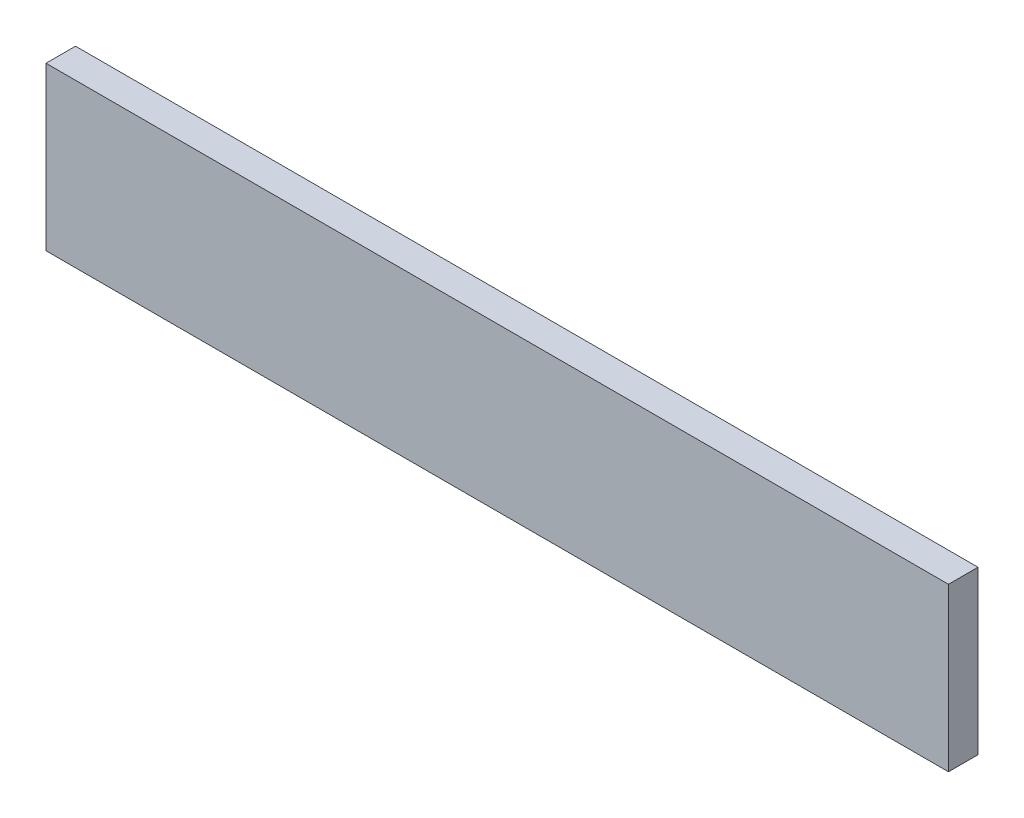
from build123d import *

# Parameters (mm, degrees)
ESQUISSE1_W      = 305.623480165
ESQUISSE1_H      = 55
EXTRUSION1_DEPTH = 10


with BuildPart() as part:
    # Esquisse1 → Extrusion1 (new body)
    with BuildSketch(Plane.XY):
        with Locations((152.811740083, -27.5)):
            Rectangle(ESQUISSE1_W, ESQUISSE1_H)
    extrude(amount=-EXTRUSION1_DEPTH)


solid = part.part
